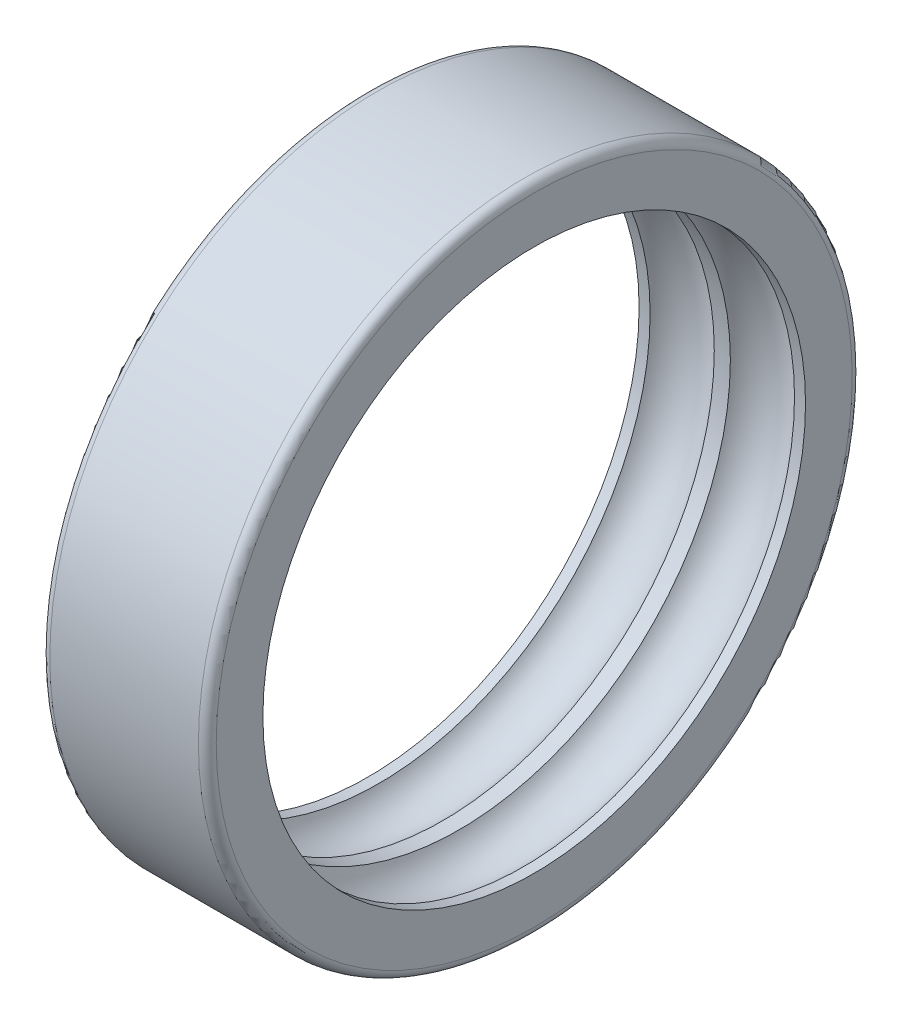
from build123d import *


with BuildPart() as part:
    # Esquisse1 → Base-R_volution (revolve)
    with BuildSketch(Plane(origin=(0, 0, 0), x_dir=(1, 0, 0), z_dir=(0, 1, 0)), mode=Mode.PRIVATE) as base_r_volution_sk:
        with BuildLine():
            Line((0, 53.5), (0, 45.65))
            Line((0, 45.65), (1.851852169, 45.65))
            ThreePointArc((1.851852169, 45.65), (7.25, 48.75), (12.648147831, 45.65))
            Line((12.648147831, 45.65), (15.351852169, 45.65))
            ThreePointArc((15.351852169, 45.65), (20.75, 48.75), (26.148147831, 45.65))
            Line((26.148147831, 45.65), (28, 45.65))
            Line((28, 45.65), (28, 53.5))
            ThreePointArc((28, 53.5), (27.560660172, 54.560660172), (26.5, 55))
            Line((26.5, 55), (1.5, 55))
            ThreePointArc((1.5, 55), (0.439339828, 54.560660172), (0, 53.5))
        make_face()
    revolve(base_r_volution_sk.sketch.rotate(Axis((0, 0, 0), (1, 0, 0)), 180), axis=Axis((0, 0, 0), (1, 0, 0)))


solid = part.part
